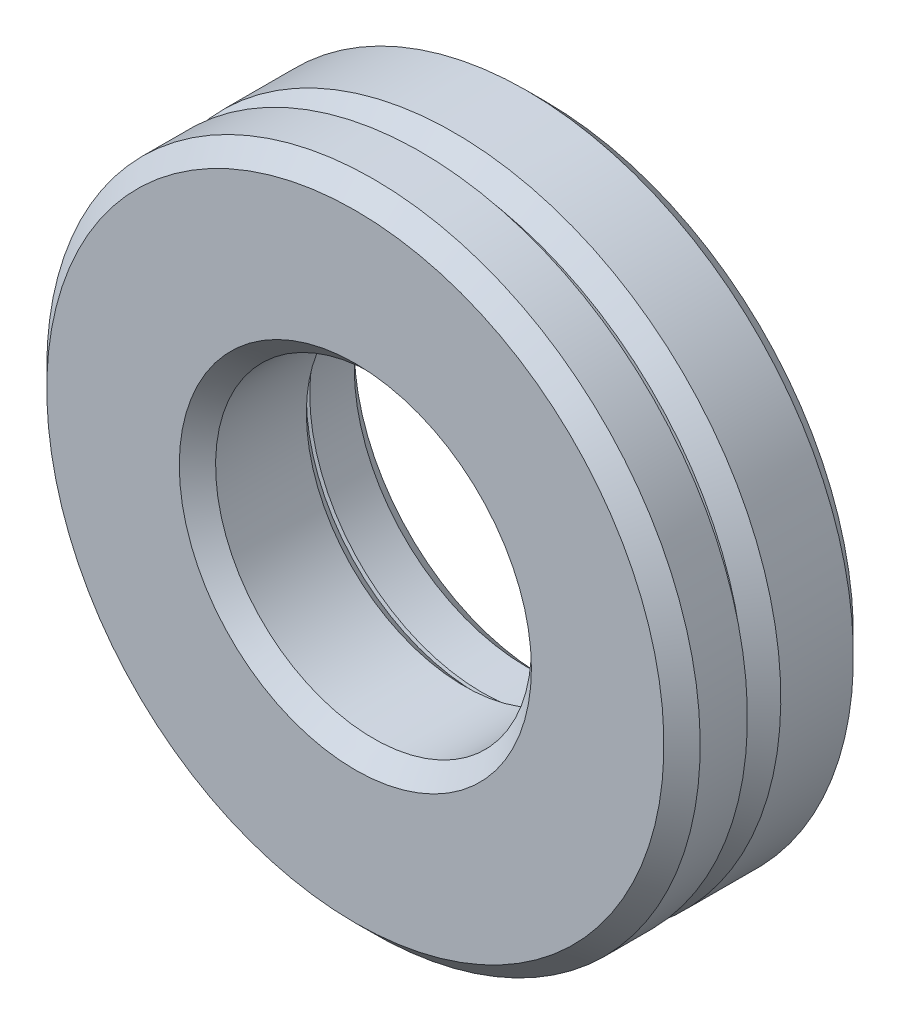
ISO-10303-21;
HEADER;
FILE_DESCRIPTION(('STEP AP214'),'2;1');
FILE_NAME('part.step','',(''),(''),'','','');
FILE_SCHEMA(('AUTOMOTIVE_DESIGN { 1 0 10303 214 1 1 1 1 }'));
ENDSEC;
DATA;
#1=APPLICATION_CONTEXT('core data for automotive mechanical design processes');
#2=APPLICATION_PROTOCOL_DEFINITION('international standard','automotive_design',2000,#1);
#3=PRODUCT_CONTEXT('',#1,'mechanical');
#4=PRODUCT('Part','Part','',(#3));
#5=PRODUCT_RELATED_PRODUCT_CATEGORY('part','',(#4));
#6=PRODUCT_DEFINITION_FORMATION('','',#4);
#7=PRODUCT_DEFINITION_CONTEXT('part definition',#1,'design');
#8=PRODUCT_DEFINITION('design','',#6,#7);
#9=PRODUCT_DEFINITION_SHAPE('','',#8);
#10=(LENGTH_UNIT() NAMED_UNIT(*) SI_UNIT(.MILLI.,.METRE.));
#11=(NAMED_UNIT(*) PLANE_ANGLE_UNIT() SI_UNIT($,.RADIAN.));
#12=(NAMED_UNIT(*) SI_UNIT($,.STERADIAN.) SOLID_ANGLE_UNIT());
#13=UNCERTAINTY_MEASURE_WITH_UNIT(LENGTH_MEASURE(1.E-05),#10,'distance_accuracy_value','');
#14=(GEOMETRIC_REPRESENTATION_CONTEXT(3) GLOBAL_UNCERTAINTY_ASSIGNED_CONTEXT((#13)) GLOBAL_UNIT_ASSIGNED_CONTEXT((#10,
#11,#12)) REPRESENTATION_CONTEXT('',''));
#15=CARTESIAN_POINT('',(0.,0.,0.));
#16=DIRECTION('',(0.,0.,1.));
#17=DIRECTION('',(1.,0.,0.));
#18=AXIS2_PLACEMENT_3D('',#15,#16,#17);
#19=CARTESIAN_POINT('',(0.,0.,3.));
#20=DIRECTION('',(0.,0.,1.));
#21=DIRECTION('',(0.,1.,0.));
#22=AXIS2_PLACEMENT_3D('',#19,#20,#21);
#23=CONICAL_SURFACE('',#22,8.25,1.22173047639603);
#24=CARTESIAN_POINT('',(0.,0.,1.7261041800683));
#25=DIRECTION('',(0.,0.,1.));
#26=DIRECTION('',(0.,1.,0.));
#27=AXIS2_PLACEMENT_3D('',#24,#25,#26);
#28=CIRCLE('',#27,4.75);
#29=CARTESIAN_POINT('',(0.,4.75,1.7261041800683));
#30=VERTEX_POINT('',#29);
#31=EDGE_CURVE('E34',#30,#30,#28,.T.);
#32=ORIENTED_EDGE('',*,*,#31,.F.);
#33=EDGE_LOOP('',(#32));
#34=FACE_BOUND('',#33,.T.);
#35=CARTESIAN_POINT('',(0.,0.,2.11849146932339));
#36=DIRECTION('',(0.,0.,1.));
#37=DIRECTION('',(0.,1.,0.));
#38=AXIS2_PLACEMENT_3D('',#35,#36,#37);
#39=CIRCLE('',#38,5.82807521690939);
#40=CARTESIAN_POINT('',(0.,5.82807521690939,2.11849146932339));
#41=VERTEX_POINT('',#40);
#42=EDGE_CURVE('E20',#41,#41,#39,.F.);
#43=ORIENTED_EDGE('',*,*,#42,.F.);
#44=EDGE_LOOP('',(#43));
#45=FACE_BOUND('',#44,.T.);
#46=ADVANCED_FACE('F12',(#34,#45),#23,.F.);
#47=CARTESIAN_POINT('',(0.,0.,3.));
#48=DIRECTION('',(0.,0.,-1.));
#49=DIRECTION('',(0.,-1.,0.));
#50=AXIS2_PLACEMENT_3D('',#47,#48,#49);
#51=PLANE('',#50);
#52=CARTESIAN_POINT('',(0.,0.,3.));
#53=DIRECTION('',(0.,0.,1.));
#54=DIRECTION('',(0.,1.,0.));
#55=AXIS2_PLACEMENT_3D('',#52,#53,#54);
#56=CIRCLE('',#55,8.25);
#57=CARTESIAN_POINT('',(0.,8.25,3.));
#58=VERTEX_POINT('',#57);
#59=EDGE_CURVE('E31',#58,#58,#56,.T.);
#60=ORIENTED_EDGE('',*,*,#59,.F.);
#61=EDGE_LOOP('',(#60));
#62=FACE_BOUND('',#61,.T.);
#63=CARTESIAN_POINT('',(0.,0.,3.));
#64=DIRECTION('',(0.,0.,-1.));
#65=DIRECTION('',(0.,-1.,0.));
#66=AXIS2_PLACEMENT_3D('',#63,#64,#65);
#67=CIRCLE('',#66,8.5);
#68=CARTESIAN_POINT('',(0.,-8.5,3.));
#69=VERTEX_POINT('',#68);
#70=EDGE_CURVE('E25',#69,#69,#67,.F.);
#71=ORIENTED_EDGE('',*,*,#70,.T.);
#72=EDGE_LOOP('',(#71));
#73=FACE_BOUND('',#72,.T.);
#74=ADVANCED_FACE('F104',(#62,#73),#51,.F.);
#75=CARTESIAN_POINT('',(0.,0.,0.));
#76=DIRECTION('',(0.,0.,-1.));
#77=DIRECTION('',(0.,-1.,0.));
#78=AXIS2_PLACEMENT_3D('',#75,#76,#77);
#79=CYLINDRICAL_SURFACE('',#78,9.);
#80=CARTESIAN_POINT('',(0.,0.,0.5));
#81=DIRECTION('',(0.,0.,1.));
#82=DIRECTION('',(0.,1.,0.));
#83=AXIS2_PLACEMENT_3D('',#80,#81,#82);
#84=CIRCLE('',#83,9.);
#85=CARTESIAN_POINT('',(0.,9.,0.5));
#86=VERTEX_POINT('',#85);
#87=EDGE_CURVE('E50',#86,#86,#84,.T.);
#88=ORIENTED_EDGE('',*,*,#87,.T.);
#89=EDGE_LOOP('',(#88));
#90=FACE_BOUND('',#89,.T.);
#91=CARTESIAN_POINT('',(0.,0.,2.5));
#92=DIRECTION('',(0.,0.,-1.));
#93=DIRECTION('',(0.,-1.,0.));
#94=AXIS2_PLACEMENT_3D('',#91,#92,#93);
#95=CIRCLE('',#94,9.);
#96=CARTESIAN_POINT('',(0.,-9.,2.5));
#97=VERTEX_POINT('',#96);
#98=EDGE_CURVE('E47',#97,#97,#95,.T.);
#99=ORIENTED_EDGE('',*,*,#98,.T.);
#100=EDGE_LOOP('',(#99));
#101=FACE_BOUND('',#100,.T.);
#102=ADVANCED_FACE('F112',(#90,#101),#79,.T.);
#103=CARTESIAN_POINT('',(0.,0.,0.));
#104=DIRECTION('',(0.,0.,1.));
#105=DIRECTION('',(0.,1.,0.));
#106=AXIS2_PLACEMENT_3D('',#103,#104,#105);
#107=PLANE('',#106);
#108=CARTESIAN_POINT('',(0.,0.,0.));
#109=DIRECTION('',(0.,0.,1.));
#110=DIRECTION('',(0.,1.,0.));
#111=AXIS2_PLACEMENT_3D('',#108,#109,#110);
#112=CIRCLE('',#111,8.5);
#113=CARTESIAN_POINT('',(0.,8.5,0.));
#114=VERTEX_POINT('',#113);
#115=EDGE_CURVE('E44',#114,#114,#112,.F.);
#116=ORIENTED_EDGE('',*,*,#115,.T.);
#117=EDGE_LOOP('',(#116));
#118=FACE_BOUND('',#117,.T.);
#119=CARTESIAN_POINT('',(0.,0.,0.));
#120=DIRECTION('',(0.,0.,1.));
#121=DIRECTION('',(0.,1.,0.));
#122=AXIS2_PLACEMENT_3D('',#119,#120,#121);
#123=CIRCLE('',#122,5.25);
#124=CARTESIAN_POINT('',(0.,5.25,0.));
#125=VERTEX_POINT('',#124);
#126=EDGE_CURVE('E41',#125,#125,#123,.T.);
#127=ORIENTED_EDGE('',*,*,#126,.T.);
#128=EDGE_LOOP('',(#127));
#129=FACE_BOUND('',#128,.T.);
#130=ADVANCED_FACE('F142',(#118,#129),#107,.F.);
#131=CARTESIAN_POINT('',(0.,0.,0.));
#132=DIRECTION('',(0.,0.,1.));
#133=DIRECTION('',(0.,1.,0.));
#134=AXIS2_PLACEMENT_3D('',#131,#132,#133);
#135=CONICAL_SURFACE('',#134,8.5,0.785398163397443);
#136=ORIENTED_EDGE('',*,*,#87,.F.);
#137=EDGE_LOOP('',(#136));
#138=FACE_BOUND('',#137,.T.);
#139=ORIENTED_EDGE('',*,*,#115,.F.);
#140=EDGE_LOOP('',(#139));
#141=FACE_BOUND('',#140,.T.);
#142=ADVANCED_FACE('F138',(#138,#141),#135,.T.);
#143=CARTESIAN_POINT('',(0.,0.,2.5));
#144=DIRECTION('',(0.,0.,-1.));
#145=DIRECTION('',(0.,-1.,0.));
#146=AXIS2_PLACEMENT_3D('',#143,#144,#145);
#147=CONICAL_SURFACE('',#146,9.,0.785398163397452);
#148=ORIENTED_EDGE('',*,*,#70,.F.);
#149=EDGE_LOOP('',(#148));
#150=FACE_BOUND('',#149,.T.);
#151=ORIENTED_EDGE('',*,*,#98,.F.);
#152=EDGE_LOOP('',(#151));
#153=FACE_BOUND('',#152,.T.);
#154=ADVANCED_FACE('F14',(#150,#153),#147,.T.);
#155=CARTESIAN_POINT('',(0.,0.,0.5));
#156=DIRECTION('',(0.,0.,-1.));
#157=DIRECTION('',(0.,-1.,0.));
#158=AXIS2_PLACEMENT_3D('',#155,#156,#157);
#159=CONICAL_SURFACE('',#158,4.75,0.785398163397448);
#160=ORIENTED_EDGE('',*,*,#126,.F.);
#161=EDGE_LOOP('',(#160));
#162=FACE_BOUND('',#161,.T.);
#163=CARTESIAN_POINT('',(0.,0.,0.5));
#164=DIRECTION('',(0.,0.,1.));
#165=DIRECTION('',(0.,1.,0.));
#166=AXIS2_PLACEMENT_3D('',#163,#164,#165);
#167=CIRCLE('',#166,4.75);
#168=CARTESIAN_POINT('',(0.,4.75,0.5));
#169=VERTEX_POINT('',#168);
#170=EDGE_CURVE('E38',#169,#169,#167,.T.);
#171=ORIENTED_EDGE('',*,*,#170,.T.);
#172=EDGE_LOOP('',(#171));
#173=FACE_BOUND('',#172,.T.);
#174=ADVANCED_FACE('F129',(#162,#173),#159,.F.);
#175=CARTESIAN_POINT('',(0.,0.,3.));
#176=DIRECTION('',(0.,0.,1.));
#177=DIRECTION('',(0.,1.,0.));
#178=AXIS2_PLACEMENT_3D('',#175,#176,#177);
#179=CYLINDRICAL_SURFACE('',#178,4.75);
#180=ORIENTED_EDGE('',*,*,#170,.F.);
#181=EDGE_LOOP('',(#180));
#182=FACE_BOUND('',#181,.T.);
#183=ORIENTED_EDGE('',*,*,#31,.T.);
#184=EDGE_LOOP('',(#183));
#185=FACE_BOUND('',#184,.T.);
#186=ADVANCED_FACE('F121',(#182,#185),#179,.F.);
#187=CARTESIAN_POINT('',(0.,0.,2.64465020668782));
#188=DIRECTION('',(0.,0.,1.));
#189=DIRECTION('',(0.,1.,0.));
#190=AXIS2_PLACEMENT_3D('',#187,#188,#189);
#191=CIRCLE('',#190,7.27368446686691);
#192=CARTESIAN_POINT('',(0.,7.27368446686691,2.64465020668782));
#193=VERTEX_POINT('',#192);
#194=EDGE_CURVE('E35',#193,#193,#191,.F.);
#195=ORIENTED_EDGE('',*,*,#194,.T.);
#196=EDGE_LOOP('',(#195));
#197=FACE_BOUND('',#196,.T.);
#198=ORIENTED_EDGE('',*,*,#59,.T.);
#199=EDGE_LOOP('',(#198));
#200=FACE_BOUND('',#199,.T.);
#201=ADVANCED_FACE('F107',(#197,#200),#23,.F.);
#202=CARTESIAN_POINT('',(0.,0.,5.22022991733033));
#203=DIRECTION('',(0.,0.,-1.));
#204=DIRECTION('',(-1.,0.,0.));
#205=AXIS2_PLACEMENT_3D('',#202,#203,#204);
#206=CYLINDRICAL_SURFACE('',#205,7.27368446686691);
#207=CARTESIAN_POINT('',(0.,0.,2.65035512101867));
#208=DIRECTION('',(0.,0.,1.));
#209=DIRECTION('',(1.,0.,0.));
#210=AXIS2_PLACEMENT_3D('',#207,#208,#209);
#211=CIRCLE('',#210,7.27368446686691);
#212=CARTESIAN_POINT('',(-7.27368446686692,0.,2.65035512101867));
#213=VERTEX_POINT('',#212);
#214=EDGE_CURVE('E8',#213,#213,#211,.T.);
#215=ORIENTED_EDGE('',*,*,#214,.F.);
#216=EDGE_LOOP('',(#215));
#217=FACE_BOUND('',#216,.T.);
#218=ORIENTED_EDGE('',*,*,#194,.F.);
#219=EDGE_LOOP('',(#218));
#220=FACE_BOUND('',#219,.T.);
#221=ADVANCED_FACE('F120',(#217,#220),#206,.T.);
#222=CARTESIAN_POINT('',(0.,0.,5.22022991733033));
#223=DIRECTION('',(0.,0.,-1.));
#224=DIRECTION('',(-1.,0.,0.));
#225=AXIS2_PLACEMENT_3D('',#222,#223,#224);
#226=CYLINDRICAL_SURFACE('',#225,5.82807521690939);
#227=CARTESIAN_POINT('',(0.,0.,2.14879800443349));
#228=DIRECTION('',(0.,0.,1.));
#229=DIRECTION('',(1.,0.,0.));
#230=AXIS2_PLACEMENT_3D('',#227,#228,#229);
#231=CIRCLE('',#230,5.82807521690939);
#232=CARTESIAN_POINT('',(-5.82807521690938,0.,2.14879800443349));
#233=VERTEX_POINT('',#232);
#234=EDGE_CURVE('E16',#233,#233,#231,.T.);
#235=ORIENTED_EDGE('',*,*,#234,.T.);
#236=EDGE_LOOP('',(#235));
#237=FACE_BOUND('',#236,.T.);
#238=ORIENTED_EDGE('',*,*,#42,.T.);
#239=EDGE_LOOP('',(#238));
#240=FACE_BOUND('',#239,.T.);
#241=ADVANCED_FACE('F127',(#237,#240),#226,.F.);
#242=CARTESIAN_POINT('',(0.,0.,5.22022991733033));
#243=DIRECTION('',(0.,0.,1.));
#244=DIRECTION('',(0.,1.,0.));
#245=AXIS2_PLACEMENT_3D('',#242,#243,#244);
#246=CONICAL_SURFACE('',#245,4.85,0.785398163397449);
#247=CARTESIAN_POINT('',(0.,0.,4.72022991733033));
#248=DIRECTION('',(0.,0.,1.));
#249=DIRECTION('',(0.,1.,0.));
#250=AXIS2_PLACEMENT_3D('',#247,#248,#249);
#251=CIRCLE('',#250,4.35);
#252=CARTESIAN_POINT('',(0.,4.34999999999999,4.72022991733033));
#253=VERTEX_POINT('',#252);
#254=EDGE_CURVE('E61',#253,#253,#251,.T.);
#255=ORIENTED_EDGE('',*,*,#254,.F.);
#256=EDGE_LOOP('',(#255));
#257=FACE_BOUND('',#256,.T.);
#258=CARTESIAN_POINT('',(0.,0.,5.22022991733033));
#259=DIRECTION('',(0.,0.,1.));
#260=DIRECTION('',(0.,1.,0.));
#261=AXIS2_PLACEMENT_3D('',#258,#259,#260);
#262=CIRCLE('',#261,4.85);
#263=CARTESIAN_POINT('',(0.,4.84999999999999,5.22022991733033));
#264=VERTEX_POINT('',#263);
#265=EDGE_CURVE('E29',#264,#264,#262,.T.);
#266=ORIENTED_EDGE('',*,*,#265,.T.);
#267=EDGE_LOOP('',(#266));
#268=FACE_BOUND('',#267,.T.);
#269=ADVANCED_FACE('F261',(#257,#268),#246,.F.);
#270=CARTESIAN_POINT('',(0.,0.,5.22022991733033));
#271=DIRECTION('',(0.,0.,1.));
#272=DIRECTION('',(0.,1.,0.));
#273=AXIS2_PLACEMENT_3D('',#270,#271,#272);
#274=CYLINDRICAL_SURFACE('',#273,4.35);
#275=CARTESIAN_POINT('',(0.,0.,2.22022991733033));
#276=DIRECTION('',(0.,0.,1.));
#277=DIRECTION('',(0.,1.,0.));
#278=AXIS2_PLACEMENT_3D('',#275,#276,#277);
#279=CIRCLE('',#278,4.35);
#280=CARTESIAN_POINT('',(0.,4.34999999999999,2.22022991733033));
#281=VERTEX_POINT('',#280);
#282=EDGE_CURVE('E65',#281,#281,#279,.T.);
#283=ORIENTED_EDGE('',*,*,#282,.F.);
#284=EDGE_LOOP('',(#283));
#285=FACE_BOUND('',#284,.T.);
#286=ORIENTED_EDGE('',*,*,#254,.T.);
#287=EDGE_LOOP('',(#286));
#288=FACE_BOUND('',#287,.T.);
#289=ADVANCED_FACE('F99',(#285,#288),#274,.F.);
#290=CARTESIAN_POINT('',(0.,0.,2.22022991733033));
#291=DIRECTION('',(0.,0.,-1.));
#292=DIRECTION('',(0.,-1.,0.));
#293=AXIS2_PLACEMENT_3D('',#290,#291,#292);
#294=CONICAL_SURFACE('',#293,4.35,0.785398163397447);
#295=CARTESIAN_POINT('',(0.,0.,1.84661756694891));
#296=DIRECTION('',(0.,0.,1.));
#297=DIRECTION('',(0.,1.,0.));
#298=AXIS2_PLACEMENT_3D('',#295,#296,#297);
#299=CIRCLE('',#298,4.72361235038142);
#300=CARTESIAN_POINT('',(-4.72361235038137,0.,1.84661756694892));
#301=VERTEX_POINT('',#300);
#302=EDGE_CURVE('E69',#301,#301,#299,.F.);
#303=ORIENTED_EDGE('',*,*,#302,.T.);
#304=EDGE_LOOP('',(#303));
#305=FACE_BOUND('',#304,.T.);
#306=ORIENTED_EDGE('',*,*,#282,.T.);
#307=EDGE_LOOP('',(#306));
#308=FACE_BOUND('',#307,.T.);
#309=ADVANCED_FACE('F84',(#305,#308),#294,.F.);
#310=CARTESIAN_POINT('',(0.,0.,21.2808010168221));
#311=DIRECTION('',(0.,0.,-1.));
#312=DIRECTION('',(-1.,0.,0.));
#313=AXIS2_PLACEMENT_3D('',#310,#311,#312);
#314=SPHERICAL_SURFACE('',#313,20.);
#315=CARTESIAN_POINT('',(-4.72361235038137,0.,1.84661756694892));
#316=CARTESIAN_POINT('',(-4.7352041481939,0.,1.84943503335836));
#317=CARTESIAN_POINT('',(-4.74679342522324,0.,1.85226287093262));
#318=CARTESIAN_POINT('',(-4.76996690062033,0.,1.8579392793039));
#319=CARTESIAN_POINT('',(-4.7815510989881,0.,1.86078785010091));
#320=CARTESIAN_POINT('',(-4.80471437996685,0.,1.86650571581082));
#321=CARTESIAN_POINT('',(-4.81629346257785,0.,1.86937501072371));
#322=CARTESIAN_POINT('',(-4.83944647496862,0.,1.87513431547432));
#323=CARTESIAN_POINT('',(-4.85102040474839,0.,1.87802432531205));
#324=CARTESIAN_POINT('',(-4.8741630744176,0.,1.88382505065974));
#325=CARTESIAN_POINT('',(-4.88573181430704,0.,1.88673576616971));
#326=CARTESIAN_POINT('',(-4.90886406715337,0.,1.89257789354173));
#327=CARTESIAN_POINT('',(-4.92042758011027,0.,1.89550930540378));
#328=CARTESIAN_POINT('',(-4.94354934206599,0.,1.90139281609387));
#329=CARTESIAN_POINT('',(-4.95510759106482,0.,1.9043449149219));
#330=CARTESIAN_POINT('',(-4.97821878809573,0.,1.91026979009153));
#331=CARTESIAN_POINT('',(-4.98977173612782,0.,1.91324256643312));
#332=CARTESIAN_POINT('',(-5.01287229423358,0.,1.91920878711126));
#333=CARTESIAN_POINT('',(-5.02441990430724,0.,1.92220223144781));
#334=CARTESIAN_POINT('',(-5.04750974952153,0.,1.92820977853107));
#335=CARTESIAN_POINT('',(-5.05905198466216,0.,1.93122388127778));
#336=CARTESIAN_POINT('',(-5.082131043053,0.,1.93727273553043));
#337=CARTESIAN_POINT('',(-5.09366786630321,0.,1.94030748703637));
#338=CARTESIAN_POINT('',(-5.11673606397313,0.,1.94639762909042));
#339=CARTESIAN_POINT('',(-5.12826743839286,0.,1.94945301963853));
#340=CARTESIAN_POINT('',(-5.1513247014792,0.,1.95558442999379));
#341=CARTESIAN_POINT('',(-5.16285059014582,0.,1.95866044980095));
#342=CARTESIAN_POINT('',(-5.18589684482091,0.,1.9648331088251));
#343=CARTESIAN_POINT('',(-5.19741721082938,0.,1.9679297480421));
#344=CARTESIAN_POINT('',(-5.2204523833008,0.,1.97414363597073));
#345=CARTESIAN_POINT('',(-5.23196718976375,0.,1.97726088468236));
#346=CARTESIAN_POINT('',(-5.25499120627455,0.,1.98351598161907));
#347=CARTESIAN_POINT('',(-5.26650041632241,0.,1.98665382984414));
#348=CARTESIAN_POINT('',(-5.2895132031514,0.,1.99295011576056));
#349=CARTESIAN_POINT('',(-5.30101677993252,0.,1.9961085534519));
#350=CARTESIAN_POINT('',(-5.32401826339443,0.,2.00244600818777));
#351=CARTESIAN_POINT('',(-5.3355161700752,0.,2.0056250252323));
#352=CARTESIAN_POINT('',(-5.35850627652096,0.,2.01200362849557));
#353=CARTESIAN_POINT('',(-5.36999847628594,0.,2.01520321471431));
#354=CARTESIAN_POINT('',(-5.39297713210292,0.,2.02162294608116));
#355=CARTESIAN_POINT('',(-5.40446358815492,0.,2.02484309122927));
#356=CARTESIAN_POINT('',(-5.42743071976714,0.,2.03130393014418));
#357=CARTESIAN_POINT('',(-5.43891139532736,0.,2.03454462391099));
#358=CARTESIAN_POINT('',(-5.46186692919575,0.,2.04104654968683));
#359=CARTESIAN_POINT('',(-5.47334178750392,0.,2.04430778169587));
#360=CARTESIAN_POINT('',(-5.49628565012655,0.,2.05085077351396));
#361=CARTESIAN_POINT('',(-5.507754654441,0.,2.05413253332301));
#362=CARTESIAN_POINT('',(-5.5306867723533,0.,2.06071657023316));
#363=CARTESIAN_POINT('',(-5.54214988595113,0.,2.06401884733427));
#364=CARTESIAN_POINT('',(-5.56507018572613,0.,2.07064390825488));
#365=CARTESIAN_POINT('',(-5.57652737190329,0.,2.07396669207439));
#366=CARTESIAN_POINT('',(-5.59943578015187,0.,2.08063275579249));
#367=CARTESIAN_POINT('',(-5.61088700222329,0.,2.08397603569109));
#368=CARTESIAN_POINT('',(-5.63378344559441,0.,2.09068308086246));
#369=CARTESIAN_POINT('',(-5.6452286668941,0.,2.09404684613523));
#370=CARTESIAN_POINT('',(-5.66811307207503,0.,2.10079485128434));
#371=CARTESIAN_POINT('',(-5.67955225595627,0.,2.10417909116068));
#372=CARTESIAN_POINT('',(-5.70242454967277,0.,2.11096803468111));
#373=CARTESIAN_POINT('',(-5.71385765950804,0.,2.1143727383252));
#374=CARTESIAN_POINT('',(-5.73671776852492,0.,2.12120259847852));
#375=CARTESIAN_POINT('',(-5.74814476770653,0.,2.12462775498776));
#376=CARTESIAN_POINT('',(-5.77099261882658,0.,2.13149850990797));
#377=CARTESIAN_POINT('',(-5.782413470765,0.,2.13494410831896));
#378=CARTESIAN_POINT('',(-5.80524899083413,0.,2.14185573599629));
#379=CARTESIAN_POINT('',(-5.81666365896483,0.,2.14532176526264));
#380=CARTESIAN_POINT('',(-5.82807521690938,0.,2.14879800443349));
#381=B_SPLINE_CURVE_WITH_KNOTS('',3,(#315,#316,#317,#318,#319,#320,#321,#322,#323,#324,#325,
#326,#327,#328,#329,#330,#331,#332,#333,#334,#335,#336,#337,#338,#339,#340,#341,#342,#343,#344,
#345,#346,#347,#348,#349,#350,#351,#352,#353,#354,#355,#356,#357,#358,#359,#360,#361,#362,#363,
#364,#365,#366,#367,#368,#369,#370,#371,#372,#373,#374,#375,#376,#377,#378,#379,#380),
.UNSPECIFIED.,.F.,.F.,(4,2,2,2,2,2,2,2,2,2,2,2,2,2,2,2,2,2,2,2,2,2,2,2,2,2,2,2,2,2,2,2,4),(0.,
0.0357878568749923,0.0715757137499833,0.107363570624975,0.143151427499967,0.17893928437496,
0.214727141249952,0.250514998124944,0.286302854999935,0.322090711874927,0.35787856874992,
0.393666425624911,0.429454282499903,0.465242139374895,0.501029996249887,0.536817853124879,
0.572605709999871,0.608393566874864,0.644181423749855,0.679969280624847,0.715757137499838,
0.751544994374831,0.787332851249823,0.823120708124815,0.858908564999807,0.894696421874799,
0.93048427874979,0.966272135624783,1.00205999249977,1.03784784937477,1.07363570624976,
1.10942356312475,1.14521141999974),.UNSPECIFIED.);
#382=EDGE_CURVE('BSEAM87',#301,#233,#381,.T.);
#383=ORIENTED_EDGE('',*,*,#302,.F.);
#384=ORIENTED_EDGE('',*,*,#234,.F.);
#385=ORIENTED_EDGE('',*,*,#382,.T.);
#386=ORIENTED_EDGE('',*,*,#382,.F.);
#387=EDGE_LOOP('',(#383,#385,#384,#386));
#388=FACE_BOUND('',#387,.T.);
#389=ADVANCED_FACE('F87',(#388),#314,.T.);
#390=CARTESIAN_POINT('',(0.,0.,3.42022991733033));
#391=DIRECTION('',(0.,0.,-1.));
#392=DIRECTION('',(0.,-1.,0.));
#393=AXIS2_PLACEMENT_3D('',#390,#391,#392);
#394=CIRCLE('',#393,9.);
#395=CARTESIAN_POINT('',(-8.99999999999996,0.,3.42022991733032));
#396=VERTEX_POINT('',#395);
#397=EDGE_CURVE('E72',#396,#396,#394,.T.);
#398=CARTESIAN_POINT('',(-7.27368446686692,0.,2.65035512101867));
#399=CARTESIAN_POINT('',(-7.29203262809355,0.,2.65751859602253));
#400=CARTESIAN_POINT('',(-7.31037020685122,0.,2.66470917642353));
#401=CARTESIAN_POINT('',(-7.34702403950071,0.,2.67914448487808));
#402=CARTESIAN_POINT('',(-7.36534029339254,0.,2.68638921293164));
#403=CARTESIAN_POINT('',(-7.40195131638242,0.,2.70093275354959));
#404=CARTESIAN_POINT('',(-7.42024608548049,0.,2.70823156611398));
#405=CARTESIAN_POINT('',(-7.45681397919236,0.,2.72288321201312));
#406=CARTESIAN_POINT('',(-7.47508710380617,0.,2.73023604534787));
#407=CARTESIAN_POINT('',(-7.51161154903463,0.,2.7449956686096));
#408=CARTESIAN_POINT('',(-7.52986286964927,0.,2.75240245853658));
#409=CARTESIAN_POINT('',(-7.56634354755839,0.,2.76726993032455));
#410=CARTESIAN_POINT('',(-7.58457290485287,0.,2.77473061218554));
#411=CARTESIAN_POINT('',(-7.62100949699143,0.,2.78970580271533));
#412=CARTESIAN_POINT('',(-7.63921673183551,0.,2.79722031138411));
#413=CARTESIAN_POINT('',(-7.67560892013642,0.,2.81230308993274));
#414=CARTESIAN_POINT('',(-7.69379387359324,0.,2.81987135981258));
#415=CARTESIAN_POINT('',(-7.73014134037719,0.,2.83506159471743));
#416=CARTESIAN_POINT('',(-7.74830385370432,0.,2.84268355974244));
#417=CARTESIAN_POINT('',(-7.78460628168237,0.,2.85798111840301));
#418=CARTESIAN_POINT('',(-7.80274619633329,0.,2.86565671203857));
#419=CARTESIAN_POINT('',(-7.83900326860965,0.,2.88106146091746));
#420=CARTESIAN_POINT('',(-7.8571204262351,0.,2.88879061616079));
#421=CARTESIAN_POINT('',(-7.89333182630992,0.,2.90430242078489));
#422=CARTESIAN_POINT('',(-7.91142606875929,0.,2.91208507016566));
#423=CARTESIAN_POINT('',(-7.9475914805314,0.,2.92770379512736));
#424=CARTESIAN_POINT('',(-7.96566264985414,0.,2.93553987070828));
#425=CARTESIAN_POINT('',(-8.0017817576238,0.,2.9512653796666));
#426=CARTESIAN_POINT('',(-8.01982969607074,0.,2.959154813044));
#427=CARTESIAN_POINT('',(-8.05590218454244,0.,2.97498696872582));
#428=CARTESIAN_POINT('',(-8.07392673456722,0.,2.98292969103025));
#429=CARTESIAN_POINT('',(-8.1099522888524,0.,2.99886835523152));
#430=CARTESIAN_POINT('',(-8.1279532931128,0.,3.00686429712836));
#431=CARTESIAN_POINT('',(-8.16393159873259,0.,3.02290933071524));
#432=CARTESIAN_POINT('',(-8.18190890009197,0.,3.03095842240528));
#433=CARTESIAN_POINT('',(-8.21783964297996,0.,3.04710968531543));
#434=CARTESIAN_POINT('',(-8.23579308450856,0.,3.05521185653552));
#435=CARTESIAN_POINT('',(-8.27167595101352,0.,3.07146920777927));
#436=CARTESIAN_POINT('',(-8.28960537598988,0.,3.07962438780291));
#437=CARTESIAN_POINT('',(-8.32544005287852,0.,3.09598768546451));
#438=CARTESIAN_POINT('',(-8.3433453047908,0.,3.10419580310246));
#439=CARTESIAN_POINT('',(-8.37913147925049,0.,3.12066490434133));
#440=CARTESIAN_POINT('',(-8.39701240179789,0.,3.12892588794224));
#441=CARTESIAN_POINT('',(-8.43274976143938,0.,3.1455006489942));
#442=CARTESIAN_POINT('',(-8.45060619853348,0.,3.15381442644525));
#443=CARTESIAN_POINT('',(-8.48629443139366,0.,3.17049470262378));
#444=CARTESIAN_POINT('',(-8.50412622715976,0.,3.17886120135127));
#445=CARTESIAN_POINT('',(-8.53976502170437,0.,3.19564684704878));
#446=CARTESIAN_POINT('',(-8.55757202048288,0.,3.2040659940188));
#447=CARTESIAN_POINT('',(-8.59316106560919,0.,3.2209568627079));
#448=CARTESIAN_POINT('',(-8.61094311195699,0.,3.22942858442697));
#449=CARTESIAN_POINT('',(-8.64648209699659,0.,3.24642452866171));
#450=CARTESIAN_POINT('',(-8.6642390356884,0.,3.25494875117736));
#451=CARTESIAN_POINT('',(-8.6997276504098,0.,3.27204962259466));
#452=CARTESIAN_POINT('',(-8.71745932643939,0.,3.28062627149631));
#453=CARTESIAN_POINT('',(-8.75289726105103,0.,3.2978319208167));
#454=CARTESIAN_POINT('',(-8.77060351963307,0.,3.30646092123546));
#455=CARTESIAN_POINT('',(-8.80599046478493,0.,3.32377119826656));
#456=CARTESIAN_POINT('',(-8.82367115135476,0.,3.33245247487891));
#457=CARTESIAN_POINT('',(-8.85900679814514,0.,3.34986722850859));
#458=CARTESIAN_POINT('',(-8.87666175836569,0.,3.35860070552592));
#459=CARTESIAN_POINT('',(-8.91194579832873,0.,3.37611978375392));
#460=CARTESIAN_POINT('',(-8.92957487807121,0.,3.38490538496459));
#461=CARTESIAN_POINT('',(-8.96480700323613,0.,3.40252863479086));
#462=CARTESIAN_POINT('',(-8.98241004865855,0.,3.41136628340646));
#463=CARTESIAN_POINT('',(-8.99999999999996,0.,3.42022991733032));
#464=B_SPLINE_CURVE_WITH_KNOTS('',3,(#398,#399,#400,#401,#402,#403,#404,#405,#406,#407,#408,
#409,#410,#411,#412,#413,#414,#415,#416,#417,#418,#419,#420,#421,#422,#423,#424,#425,#426,#427,
#428,#429,#430,#431,#432,#433,#434,#435,#436,#437,#438,#439,#440,#441,#442,#443,#444,#445,#446,
#447,#448,#449,#450,#451,#452,#453,#454,#455,#456,#457,#458,#459,#460,#461,#462,#463),
.UNSPECIFIED.,.F.,.F.,(4,2,2,2,2,2,2,2,2,2,2,2,2,2,2,2,2,2,2,2,2,2,2,2,2,2,2,2,2,2,2,2,4),(0.,
0.0590908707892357,0.118181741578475,0.17727261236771,0.236363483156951,0.295454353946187,
0.354545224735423,0.413636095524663,0.4727269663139,0.531817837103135,0.590908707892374,
0.649999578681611,0.709090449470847,0.768181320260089,0.827272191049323,0.886363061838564,
0.9454539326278,1.00454480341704,1.06363567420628,1.12272654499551,1.18181741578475,
1.24090828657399,1.29999915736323,1.35909002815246,1.4181808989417,1.47727176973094,
1.53636264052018,1.59545351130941,1.65454438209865,1.71363525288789,1.77272612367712,
1.83181699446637,1.8909078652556),.UNSPECIFIED.);
#465=EDGE_CURVE('BSEAM90',#213,#396,#464,.T.);
#466=ORIENTED_EDGE('',*,*,#214,.T.);
#467=ORIENTED_EDGE('',*,*,#397,.T.);
#468=ORIENTED_EDGE('',*,*,#465,.T.);
#469=ORIENTED_EDGE('',*,*,#465,.F.);
#470=EDGE_LOOP('',(#466,#468,#467,#469));
#471=FACE_BOUND('',#470,.T.);
#472=ADVANCED_FACE('F90',(#471),#314,.T.);
#473=CARTESIAN_POINT('',(0.,0.,1.72022991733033));
#474=DIRECTION('',(0.,0.,-1.));
#475=DIRECTION('',(0.,-1.,0.));
#476=AXIS2_PLACEMENT_3D('',#473,#474,#475);
#477=CYLINDRICAL_SURFACE('',#476,9.);
#478=CARTESIAN_POINT('',(0.,0.,4.72022991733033));
#479=DIRECTION('',(0.,0.,1.));
#480=DIRECTION('',(0.,1.,0.));
#481=AXIS2_PLACEMENT_3D('',#478,#479,#480);
#482=CIRCLE('',#481,9.);
#483=CARTESIAN_POINT('',(0.,8.99999999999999,4.72022991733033));
#484=VERTEX_POINT('',#483);
#485=EDGE_CURVE('E75',#484,#484,#482,.F.);
#486=ORIENTED_EDGE('',*,*,#485,.T.);
#487=EDGE_LOOP('',(#486));
#488=FACE_BOUND('',#487,.T.);
#489=ORIENTED_EDGE('',*,*,#397,.F.);
#490=EDGE_LOOP('',(#489));
#491=FACE_BOUND('',#490,.T.);
#492=ADVANCED_FACE('F98',(#488,#491),#477,.T.);
#493=CARTESIAN_POINT('',(0.,0.,4.72022991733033));
#494=DIRECTION('',(0.,0.,-1.));
#495=DIRECTION('',(0.,-1.,0.));
#496=AXIS2_PLACEMENT_3D('',#493,#494,#495);
#497=CONICAL_SURFACE('',#496,9.,0.78539816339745);
#498=CARTESIAN_POINT('',(0.,0.,5.22022991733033));
#499=DIRECTION('',(0.,0.,1.));
#500=DIRECTION('',(0.,1.,0.));
#501=AXIS2_PLACEMENT_3D('',#498,#499,#500);
#502=CIRCLE('',#501,8.5);
#503=CARTESIAN_POINT('',(0.,8.49999999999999,5.22022991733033));
#504=VERTEX_POINT('',#503);
#505=EDGE_CURVE('E78',#504,#504,#502,.T.);
#506=ORIENTED_EDGE('',*,*,#505,.F.);
#507=EDGE_LOOP('',(#506));
#508=FACE_BOUND('',#507,.T.);
#509=ORIENTED_EDGE('',*,*,#485,.F.);
#510=EDGE_LOOP('',(#509));
#511=FACE_BOUND('',#510,.T.);
#512=ADVANCED_FACE('F237',(#508,#511),#497,.T.);
#513=CARTESIAN_POINT('',(0.,0.,5.22022991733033));
#514=DIRECTION('',(0.,0.,-1.));
#515=DIRECTION('',(-1.,0.,0.));
#516=AXIS2_PLACEMENT_3D('',#513,#514,#515);
#517=PLANE('',#516);
#518=ORIENTED_EDGE('',*,*,#265,.F.);
#519=EDGE_LOOP('',(#518));
#520=FACE_BOUND('',#519,.T.);
#521=ORIENTED_EDGE('',*,*,#505,.T.);
#522=EDGE_LOOP('',(#521));
#523=FACE_BOUND('',#522,.T.);
#524=ADVANCED_FACE('F244',(#520,#523),#517,.F.);
#525=CLOSED_SHELL('',(#46,#74,#102,#130,#142,#154,#174,#186,#201,#221,#241,#269,#289,#309,#389,
#472,#492,#512,#524));
#526=MANIFOLD_SOLID_BREP('B1',#525);
#527=ADVANCED_BREP_SHAPE_REPRESENTATION('',(#18,#526),#14);
#528=SHAPE_DEFINITION_REPRESENTATION(#9,#527);
ENDSEC;
END-ISO-10303-21;
